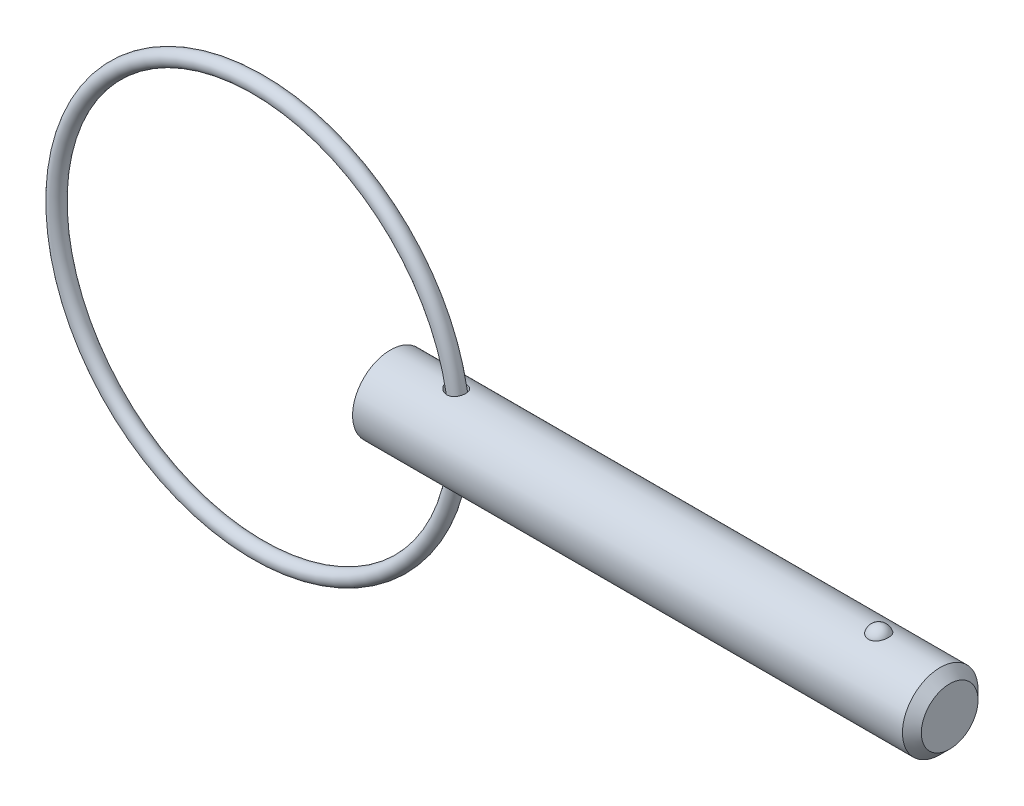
ISO-10303-21;
HEADER;
FILE_DESCRIPTION(('STEP AP214'),'2;1');
FILE_NAME('part.step','',(''),(''),'','','');
FILE_SCHEMA(('AUTOMOTIVE_DESIGN { 1 0 10303 214 1 1 1 1 }'));
ENDSEC;
DATA;
#1=APPLICATION_CONTEXT('core data for automotive mechanical design processes');
#2=APPLICATION_PROTOCOL_DEFINITION('international standard','automotive_design',2000,#1);
#3=PRODUCT_CONTEXT('',#1,'mechanical');
#4=PRODUCT('Part','Part','',(#3));
#5=PRODUCT_RELATED_PRODUCT_CATEGORY('part','',(#4));
#6=PRODUCT_DEFINITION_FORMATION('','',#4);
#7=PRODUCT_DEFINITION_CONTEXT('part definition',#1,'design');
#8=PRODUCT_DEFINITION('design','',#6,#7);
#9=PRODUCT_DEFINITION_SHAPE('','',#8);
#10=(LENGTH_UNIT() NAMED_UNIT(*) SI_UNIT(.MILLI.,.METRE.));
#11=(NAMED_UNIT(*) PLANE_ANGLE_UNIT() SI_UNIT($,.RADIAN.));
#12=(NAMED_UNIT(*) SI_UNIT($,.STERADIAN.) SOLID_ANGLE_UNIT());
#13=UNCERTAINTY_MEASURE_WITH_UNIT(LENGTH_MEASURE(1.E-05),#10,'distance_accuracy_value','');
#14=(GEOMETRIC_REPRESENTATION_CONTEXT(3) GLOBAL_UNCERTAINTY_ASSIGNED_CONTEXT((#13)) GLOBAL_UNIT_ASSIGNED_CONTEXT((#10,
#11,#12)) REPRESENTATION_CONTEXT('',''));
#15=CARTESIAN_POINT('',(0.,0.,0.));
#16=DIRECTION('',(0.,0.,1.));
#17=DIRECTION('',(1.,0.,0.));
#18=AXIS2_PLACEMENT_3D('',#15,#16,#17);
#19=CARTESIAN_POINT('',(-8.3302379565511,0.,0.));
#20=DIRECTION('',(0.,0.,1.));
#21=DIRECTION('',(1.,0.,0.));
#22=AXIS2_PLACEMENT_3D('',#19,#20,#21);
#23=TOROIDAL_SURFACE('',#22,12.7,0.476000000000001);
#24=CARTESIAN_POINT('',(4.8457620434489,0.,0.));
#25=VERTEX_POINT('',#24);
#26=VERTEX_LOOP('',#25);
#27=FACE_BOUND('',#26,.T.);
#28=ADVANCED_FACE('P0_F12',(#27),#23,.T.);
#29=CLOSED_SHELL('',(#28));
#30=MANIFOLD_SOLID_BREP('P0_B1',#29);
#31=CARTESIAN_POINT('',(0.,0.,0.));
#32=DIRECTION('',(1.,0.,0.));
#33=DIRECTION('',(0.,0.,-1.));
#34=AXIS2_PLACEMENT_3D('',#31,#32,#33);
#35=CYLINDRICAL_SURFACE('',#34,2.38);
#36=CARTESIAN_POINT('',(3.67748265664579,2.35074198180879,-0.372037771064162));
#37=CARTESIAN_POINT('',(3.70046616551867,2.34644965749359,-0.399158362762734));
#38=CARTESIAN_POINT('',(3.72581651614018,2.34199234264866,-0.424274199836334));
#39=CARTESIAN_POINT('',(3.78042747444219,2.33326580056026,-0.469907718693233));
#40=CARTESIAN_POINT('',(3.80969342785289,2.32899684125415,-0.490419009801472));
#41=CARTESIAN_POINT('',(3.87128330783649,2.32114904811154,-0.526312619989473));
#42=CARTESIAN_POINT('',(3.90360537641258,2.31756979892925,-0.541698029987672));
#43=CARTESIAN_POINT('',(3.9704452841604,2.31153734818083,-0.566889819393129));
#44=CARTESIAN_POINT('',(4.0049621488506,2.30908365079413,-0.576698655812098));
#45=CARTESIAN_POINT('',(4.07500735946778,2.30564492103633,-0.590297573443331));
#46=CARTESIAN_POINT('',(4.1105275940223,2.30465036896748,-0.594126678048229));
#47=CARTESIAN_POINT('',(4.18170718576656,2.30426876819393,-0.595606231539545));
#48=CARTESIAN_POINT('',(4.21736649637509,2.30488122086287,-0.593258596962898));
#49=CARTESIAN_POINT('',(4.28577822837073,2.30759475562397,-0.582609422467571));
#50=CARTESIAN_POINT('',(4.31858437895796,2.30961492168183,-0.57463122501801));
#51=CARTESIAN_POINT('',(4.38227060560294,2.31483318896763,-0.55323387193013));
#52=CARTESIAN_POINT('',(4.41315097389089,2.31803111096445,-0.539815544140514));
#53=CARTESIAN_POINT('',(4.4711825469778,2.3251225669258,-0.508384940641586));
#54=CARTESIAN_POINT('',(4.49841743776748,2.32899254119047,-0.490521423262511));
#55=CARTESIAN_POINT('',(4.5494826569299,2.33706025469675,-0.450515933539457));
#56=CARTESIAN_POINT('',(4.57331285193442,2.34125800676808,-0.428373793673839));
#57=CARTESIAN_POINT('',(4.6171621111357,2.34956202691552,-0.380209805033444));
#58=CARTESIAN_POINT('',(4.63714543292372,2.35366715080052,-0.354155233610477));
#59=CARTESIAN_POINT('',(4.67254725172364,2.36130301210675,-0.299034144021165));
#60=CARTESIAN_POINT('',(4.68796545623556,2.36483371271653,-0.269967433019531));
#61=CARTESIAN_POINT('',(4.71403776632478,2.37098548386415,-0.209215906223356));
#62=CARTESIAN_POINT('',(4.72462580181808,2.37359383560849,-0.177501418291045));
#63=CARTESIAN_POINT('',(4.74046966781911,2.37755210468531,-0.112692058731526));
#64=CARTESIAN_POINT('',(4.74572552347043,2.37890202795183,-0.0795971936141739));
#65=CARTESIAN_POINT('',(4.75077448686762,2.38019811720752,-0.0129544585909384));
#66=CARTESIAN_POINT('',(4.75056573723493,2.38014380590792,0.0205935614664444));
#67=CARTESIAN_POINT('',(4.74468604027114,2.37863606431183,0.087175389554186));
#68=CARTESIAN_POINT('',(4.73901506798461,2.37718262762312,0.120209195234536));
#69=CARTESIAN_POINT('',(4.72236472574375,2.37303648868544,0.184779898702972));
#70=CARTESIAN_POINT('',(4.71139268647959,2.37034549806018,0.216318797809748));
#71=CARTESIAN_POINT('',(4.68441400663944,2.36401552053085,0.277063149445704));
#72=CARTESIAN_POINT('',(4.6684071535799,2.36037649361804,0.30626850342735));
#73=CARTESIAN_POINT('',(4.63170627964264,2.35253749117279,0.361595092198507));
#74=CARTESIAN_POINT('',(4.61100040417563,2.34833610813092,0.387708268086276));
#75=CARTESIAN_POINT('',(4.56544852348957,2.33984863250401,0.43601731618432));
#76=CARTESIAN_POINT('',(4.54060272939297,2.33556254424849,0.458213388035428));
#77=CARTESIAN_POINT('',(4.48760111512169,2.32742099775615,0.497916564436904));
#78=CARTESIAN_POINT('',(4.45946763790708,2.32356294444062,0.515452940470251));
#79=CARTESIAN_POINT('',(4.40055109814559,2.31668866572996,0.545520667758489));
#80=CARTESIAN_POINT('',(4.36976845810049,2.31367230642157,0.558052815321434));
#81=CARTESIAN_POINT('',(4.30694930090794,2.30886128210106,0.577633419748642));
#82=CARTESIAN_POINT('',(4.27493988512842,2.30704826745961,0.584764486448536));
#83=CARTESIAN_POINT('',(4.21014558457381,2.30475365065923,0.593744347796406));
#84=CARTESIAN_POINT('',(4.17736068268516,2.30427207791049,0.595593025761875));
#85=CARTESIAN_POINT('',(4.11170515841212,2.30466513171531,0.59406986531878));
#86=CARTESIAN_POINT('',(4.07883545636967,2.30554895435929,0.5906626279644));
#87=CARTESIAN_POINT('',(4.01408593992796,2.30856010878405,0.578780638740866));
#88=CARTESIAN_POINT('',(3.98220636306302,2.31068773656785,0.570304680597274));
#89=CARTESIAN_POINT('',(3.91877258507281,2.31605973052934,0.548090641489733));
#90=CARTESIAN_POINT('',(3.88730095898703,2.31935100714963,0.534128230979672));
#91=CARTESIAN_POINT('',(3.82705133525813,2.32664713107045,0.501391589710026));
#92=CARTESIAN_POINT('',(3.79827429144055,2.33065222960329,0.482615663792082));
#93=CARTESIAN_POINT('',(3.7429634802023,2.3391254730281,0.439760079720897));
#94=CARTESIAN_POINT('',(3.71658313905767,2.3436062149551,0.415484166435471));
#95=CARTESIAN_POINT('',(3.6683951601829,2.35235146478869,0.362706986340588));
#96=CARTESIAN_POINT('',(3.64658727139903,2.35661598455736,0.334205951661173));
#97=CARTESIAN_POINT('',(3.60882605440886,2.36432007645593,0.27436882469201));
#98=CARTESIAN_POINT('',(3.59274982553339,2.36777633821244,0.243112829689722));
#99=CARTESIAN_POINT('',(3.56652169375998,2.3735493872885,0.178112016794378));
#100=CARTESIAN_POINT('',(3.5563653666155,2.3758670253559,0.144369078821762));
#101=CARTESIAN_POINT('',(3.54309691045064,2.37891982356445,0.0783638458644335));
#102=CARTESIAN_POINT('',(3.53947205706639,2.37976992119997,0.0462095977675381));
#103=CARTESIAN_POINT('',(3.53785288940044,2.38014795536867,-0.0182487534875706));
#104=CARTESIAN_POINT('',(3.5398575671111,2.37967612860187,-0.0505528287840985));
#105=CARTESIAN_POINT('',(3.54913867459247,2.37752661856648,-0.112617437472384));
#106=CARTESIAN_POINT('',(3.5561353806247,2.37591295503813,-0.142422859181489));
#107=CARTESIAN_POINT('',(3.5747775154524,2.37172196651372,-0.20045124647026));
#108=CARTESIAN_POINT('',(3.58642049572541,2.36914514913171,-0.228675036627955));
#109=CARTESIAN_POINT('',(3.61071901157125,2.36396321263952,-0.276620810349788));
#110=CARTESIAN_POINT('',(3.62251818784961,2.36150235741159,-0.296799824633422));
#111=CARTESIAN_POINT('',(3.64836661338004,2.35629864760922,-0.335619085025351));
#112=CARTESIAN_POINT('',(3.66241608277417,2.353555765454,-0.354259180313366));
#113=CARTESIAN_POINT('',(3.67748265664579,2.35074198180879,-0.372037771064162));
#114=B_SPLINE_CURVE_WITH_KNOTS('',3,(#36,#37,#38,#39,#40,#41,#42,#43,#44,#45,#46,#47,#48,#49,
#50,#51,#52,#53,#54,#55,#56,#57,#58,#59,#60,#61,#62,#63,#64,#65,#66,#67,#68,#69,#70,#71,#72,#73,
#74,#75,#76,#77,#78,#79,#80,#81,#82,#83,#84,#85,#86,#87,#88,#89,#90,#91,#92,#93,#94,#95,#96,#97,
#98,#99,#100,#101,#102,#103,#104,#105,#106,#107,#108,#109,#110,#111,#112,#113),.UNSPECIFIED.,
.T.,.F.,(4,2,2,2,2,2,2,2,2,2,2,2,2,2,2,2,2,2,2,2,2,2,2,2,2,2,2,2,2,2,2,2,2,2,2,2,2,2,4),(0.,
0.107335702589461,0.214819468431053,0.322238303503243,0.429609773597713,0.536277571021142,
0.642912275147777,0.743874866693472,0.844822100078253,0.942762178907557,1.04070609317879,
1.13952022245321,1.23834068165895,1.33847507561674,1.43860899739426,1.53877695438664,
1.63894536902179,1.73897565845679,1.83901017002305,1.93929990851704,2.03958453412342,
2.13922343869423,2.23884648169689,2.33691317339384,2.43498203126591,2.53371427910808,
2.63247003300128,2.73577311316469,2.83911262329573,2.94697761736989,3.05483668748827,
3.16021984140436,3.2655241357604,3.36212700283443,3.45871257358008,3.55027266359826,
3.64178456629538,3.71214035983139,3.78250304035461),.UNSPECIFIED.);
#115=CARTESIAN_POINT('',(3.67748265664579,2.35074198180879,-0.372037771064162));
#116=VERTEX_POINT('',#115);
#117=EDGE_CURVE('P1_E40',#116,#116,#114,.T.);
#118=ORIENTED_EDGE('',*,*,#117,.T.);
#119=EDGE_LOOP('',(#118));
#120=FACE_BOUND('',#119,.T.);
#121=CARTESIAN_POINT('',(34.635,0.,0.));
#122=DIRECTION('',(1.,0.,0.));
#123=DIRECTION('',(0.,0.,-1.));
#124=AXIS2_PLACEMENT_3D('',#121,#122,#123);
#125=CIRCLE('',#124,2.38);
#126=CARTESIAN_POINT('',(34.635,0.,-2.38));
#127=VERTEX_POINT('',#126);
#128=EDGE_CURVE('P1_E25',#127,#127,#125,.T.);
#129=ORIENTED_EDGE('',*,*,#128,.F.);
#130=EDGE_LOOP('',(#129));
#131=FACE_BOUND('',#130,.T.);
#132=CARTESIAN_POINT('',(0.,0.,0.));
#133=DIRECTION('',(1.,0.,0.));
#134=DIRECTION('',(0.,0.,-1.));
#135=AXIS2_PLACEMENT_3D('',#132,#133,#134);
#136=CIRCLE('',#135,2.38);
#137=CARTESIAN_POINT('',(0.,0.,-2.38));
#138=VERTEX_POINT('',#137);
#139=EDGE_CURVE('P1_E9',#138,#138,#136,.T.);
#140=ORIENTED_EDGE('',*,*,#139,.T.);
#141=EDGE_LOOP('',(#140));
#142=FACE_BOUND('',#141,.T.);
#143=CARTESIAN_POINT('',(30.7634492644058,2.2921568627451,0.640637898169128));
#144=CARTESIAN_POINT('',(30.7303559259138,2.29215737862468,0.640637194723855));
#145=CARTESIAN_POINT('',(30.6972546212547,2.29293179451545,0.637884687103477));
#146=CARTESIAN_POINT('',(30.6320176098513,2.29594030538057,0.626968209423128));
#147=CARTESIAN_POINT('',(30.5998823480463,2.29817506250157,0.618801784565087));
#148=CARTESIAN_POINT('',(30.5375402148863,2.30384308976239,0.597351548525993));
#149=CARTESIAN_POINT('',(30.5073305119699,2.30727454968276,0.584075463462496));
#150=CARTESIAN_POINT('',(30.4495674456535,2.31495941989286,0.55282960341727));
#151=CARTESIAN_POINT('',(30.4220141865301,2.31921286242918,0.53485964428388));
#152=CARTESIAN_POINT('',(30.3695938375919,2.32820213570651,0.494282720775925));
#153=CARTESIAN_POINT('',(30.3448050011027,2.33294694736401,0.471576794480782));
#154=CARTESIAN_POINT('',(30.2992169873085,2.34234144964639,0.422446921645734));
#155=CARTESIAN_POINT('',(30.2784185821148,2.34699112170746,0.396022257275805));
#156=CARTESIAN_POINT('',(30.2403580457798,2.35593942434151,0.338855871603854));
#157=CARTESIAN_POINT('',(30.2233051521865,2.36021170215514,0.30797060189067));
#158=CARTESIAN_POINT('',(30.1943607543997,2.3677057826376,0.24375057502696));
#159=CARTESIAN_POINT('',(30.1824701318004,2.37092740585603,0.210415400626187));
#160=CARTESIAN_POINT('',(30.1638076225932,2.37606901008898,0.141189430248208));
#161=CARTESIAN_POINT('',(30.1571956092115,2.37794816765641,0.105252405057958));
#162=CARTESIAN_POINT('',(30.1498095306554,2.38005135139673,0.0327351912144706));
#163=CARTESIAN_POINT('',(30.1490358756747,2.38027526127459,-0.00384504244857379));
#164=CARTESIAN_POINT('',(30.1533628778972,2.37903842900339,-0.0769838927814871));
#165=CARTESIAN_POINT('',(30.1585202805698,2.37756141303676,-0.113538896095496));
#166=CARTESIAN_POINT('',(30.1747013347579,2.37305303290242,-0.185229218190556));
#167=CARTESIAN_POINT('',(30.1857251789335,2.37002161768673,-0.220364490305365));
#168=CARTESIAN_POINT('',(30.2133977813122,2.36273722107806,-0.28815667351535));
#169=CARTESIAN_POINT('',(30.2300389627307,2.35848588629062,-0.320816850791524));
#170=CARTESIAN_POINT('',(30.2685984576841,2.34923130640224,-0.382744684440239));
#171=CARTESIAN_POINT('',(30.290516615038,2.34422808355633,-0.412012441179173));
#172=CARTESIAN_POINT('',(30.3387549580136,2.33412555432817,-0.465830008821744));
#173=CARTESIAN_POINT('',(30.365002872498,2.32902887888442,-0.490444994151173));
#174=CARTESIAN_POINT('',(30.4214769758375,2.31926941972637,-0.534700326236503));
#175=CARTESIAN_POINT('',(30.451702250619,2.3146065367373,-0.554341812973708));
#176=CARTESIAN_POINT('',(30.5140618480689,2.30645675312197,-0.587312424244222));
#177=CARTESIAN_POINT('',(30.5460780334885,2.30293152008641,-0.600855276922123));
#178=CARTESIAN_POINT('',(30.6120795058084,2.29725171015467,-0.62222045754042));
#179=CARTESIAN_POINT('',(30.6460641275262,2.29509667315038,-0.63004470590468));
#180=CARTESIAN_POINT('',(30.713299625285,2.29249264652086,-0.639452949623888));
#181=CARTESIAN_POINT('',(30.7465087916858,2.29196755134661,-0.641315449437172));
#182=CARTESIAN_POINT('',(30.812763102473,2.29246849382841,-0.639522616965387));
#183=CARTESIAN_POINT('',(30.8458082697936,2.29349430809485,-0.635868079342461));
#184=CARTESIAN_POINT('',(30.9101025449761,2.29694059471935,-0.623301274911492));
#185=CARTESIAN_POINT('',(30.9413744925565,2.29933234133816,-0.614497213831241));
#186=CARTESIAN_POINT('',(31.0019952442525,2.30522511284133,-0.592006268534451));
#187=CARTESIAN_POINT('',(31.0313438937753,2.30872622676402,-0.578318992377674));
#188=CARTESIAN_POINT('',(31.0880369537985,2.31655795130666,-0.546112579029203));
#189=CARTESIAN_POINT('',(31.115320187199,2.32090569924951,-0.527490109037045));
#190=CARTESIAN_POINT('',(31.1664904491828,2.32992206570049,-0.486117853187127));
#191=CARTESIAN_POINT('',(31.1903767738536,2.33459075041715,-0.463367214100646));
#192=CARTESIAN_POINT('',(31.2352722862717,2.34399834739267,-0.413220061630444));
#193=CARTESIAN_POINT('',(31.2560972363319,2.34873051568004,-0.385657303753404));
#194=CARTESIAN_POINT('',(31.293056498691,2.35754932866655,-0.32745560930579));
#195=CARTESIAN_POINT('',(31.3091898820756,2.36163584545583,-0.296816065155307));
#196=CARTESIAN_POINT('',(31.3369822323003,2.36889321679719,-0.232047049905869));
#197=CARTESIAN_POINT('',(31.3484450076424,2.37202275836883,-0.19782862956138));
#198=CARTESIAN_POINT('',(31.3657523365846,2.37681926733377,-0.127900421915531));
#199=CARTESIAN_POINT('',(31.3715962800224,2.37848607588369,-0.0921904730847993));
#200=CARTESIAN_POINT('',(31.377605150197,2.38020024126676,-0.0196348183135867));
#201=CARTESIAN_POINT('',(31.3776704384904,2.38021918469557,0.0172198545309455));
#202=CARTESIAN_POINT('',(31.3718689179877,2.37856356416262,0.0904219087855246));
#203=CARTESIAN_POINT('',(31.3660018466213,2.37688892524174,0.126769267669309));
#204=CARTESIAN_POINT('',(31.348425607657,2.37201688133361,0.198028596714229));
#205=CARTESIAN_POINT('',(31.336699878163,2.36881516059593,0.232936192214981));
#206=CARTESIAN_POINT('',(31.3076354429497,2.36123444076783,0.30019678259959));
#207=CARTESIAN_POINT('',(31.2902967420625,2.3568554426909,0.332549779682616));
#208=CARTESIAN_POINT('',(31.2505350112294,2.34744667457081,0.393495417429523));
#209=CARTESIAN_POINT('',(31.2281528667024,2.34242227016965,0.422115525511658));
#210=CARTESIAN_POINT('',(31.1787391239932,2.33227293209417,0.475004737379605));
#211=CARTESIAN_POINT('',(31.1517076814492,2.32714800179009,0.4992739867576));
#212=CARTESIAN_POINT('',(31.0944988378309,2.31755359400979,0.542046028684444));
#213=CARTESIAN_POINT('',(31.0644297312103,2.31306986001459,0.560690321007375));
#214=CARTESIAN_POINT('',(31.0013869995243,2.3051412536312,0.592447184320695));
#215=CARTESIAN_POINT('',(30.9684158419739,2.30169550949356,0.605564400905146));
#216=CARTESIAN_POINT('',(30.9068424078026,2.29677744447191,0.623927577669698));
#217=CARTESIAN_POINT('',(30.8785555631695,2.29505839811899,0.630178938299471));
#218=CARTESIAN_POINT('',(30.8213308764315,2.29274795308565,0.638534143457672));
#219=CARTESIAN_POINT('',(30.7923931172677,2.29215641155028,0.64063851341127));
#220=CARTESIAN_POINT('',(30.7634492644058,2.2921568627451,0.640637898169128));
#221=B_SPLINE_CURVE_WITH_KNOTS('',3,(#143,#144,#145,#146,#147,#148,#149,#150,#151,#152,#153,
#154,#155,#156,#157,#158,#159,#160,#161,#162,#163,#164,#165,#166,#167,#168,#169,#170,#171,#172,
#173,#174,#175,#176,#177,#178,#179,#180,#181,#182,#183,#184,#185,#186,#187,#188,#189,#190,#191,
#192,#193,#194,#195,#196,#197,#198,#199,#200,#201,#202,#203,#204,#205,#206,#207,#208,#209,#210,
#211,#212,#213,#214,#215,#216,#217,#218,#219,#220),.UNSPECIFIED.,.T.,.F.,(4,2,2,2,2,2,2,2,2,2,2,
2,2,2,2,2,2,2,2,2,2,2,2,2,2,2,2,2,2,2,2,2,2,2,2,2,2,2,4),(0.,0.0991724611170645,
0.198389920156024,0.297457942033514,0.396529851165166,0.497927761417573,0.599345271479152,
0.705475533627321,0.811623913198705,0.920876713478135,1.03013718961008,1.1404517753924,
1.25076998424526,1.3609399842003,1.47110672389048,1.57959248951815,1.6880533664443,
1.79234266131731,1.89659691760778,1.99590391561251,2.0951966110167,2.19247425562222,
2.28975970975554,2.38926978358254,2.48880044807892,2.59293588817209,2.69709193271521,
2.80525821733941,2.91343624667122,3.02347917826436,3.13352698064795,3.24388765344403,
3.35424823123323,3.46374443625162,3.57323697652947,3.67968690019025,3.78604717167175,
3.87279565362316,3.95953314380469),.UNSPECIFIED.);
#222=CARTESIAN_POINT('',(30.7634492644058,2.2921568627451,0.640637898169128));
#223=VERTEX_POINT('',#222);
#224=EDGE_CURVE('P1_E34',#223,#223,#221,.T.);
#225=ORIENTED_EDGE('',*,*,#224,.T.);
#226=EDGE_LOOP('',(#225));
#227=FACE_BOUND('',#226,.T.);
#228=CARTESIAN_POINT('',(3.67748265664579,-2.35074198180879,-0.372037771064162));
#229=CARTESIAN_POINT('',(3.65652023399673,-2.35465684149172,-0.34730037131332));
#230=CARTESIAN_POINT('',(3.63751328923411,-2.35843676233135,-0.320880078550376));
#231=CARTESIAN_POINT('',(3.60404107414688,-2.36534227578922,-0.265218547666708));
#232=CARTESIAN_POINT('',(3.58957485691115,-2.36846800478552,-0.235977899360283));
#233=CARTESIAN_POINT('',(3.56572865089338,-2.37373250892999,-0.17528149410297));
#234=CARTESIAN_POINT('',(3.55636565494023,-2.37586798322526,-0.143818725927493));
#235=CARTESIAN_POINT('',(3.54325775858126,-2.37888184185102,-0.0796854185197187));
#236=CARTESIAN_POINT('',(3.539510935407,-2.37976065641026,-0.0470152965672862));
#237=CARTESIAN_POINT('',(3.53787230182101,-2.38014359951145,0.0167788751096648));
#238=CARTESIAN_POINT('',(3.53968714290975,-2.37971660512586,0.0478953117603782));
#239=CARTESIAN_POINT('',(3.54844977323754,-2.37768530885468,0.109352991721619));
#240=CARTESIAN_POINT('',(3.55539746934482,-2.37608102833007,0.139694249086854));
#241=CARTESIAN_POINT('',(3.57400783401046,-2.37189301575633,0.198451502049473));
#242=CARTESIAN_POINT('',(3.58561918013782,-2.36931996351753,0.226884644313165));
#243=CARTESIAN_POINT('',(3.61310377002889,-2.36345094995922,0.281524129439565));
#244=CARTESIAN_POINT('',(3.62897804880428,-2.36015481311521,0.30772992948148));
#245=CARTESIAN_POINT('',(3.66562367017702,-2.35291979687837,0.359001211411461));
#246=CARTESIAN_POINT('',(3.68664499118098,-2.34895316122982,0.383883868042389));
#247=CARTESIAN_POINT('',(3.73230875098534,-2.34094029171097,0.430056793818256));
#248=CARTESIAN_POINT('',(3.75695270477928,-2.33689402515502,0.451345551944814));
#249=CARTESIAN_POINT('',(3.81128123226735,-2.32880869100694,0.491427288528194));
#250=CARTESIAN_POINT('',(3.84120889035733,-2.32479472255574,0.509896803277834));
#251=CARTESIAN_POINT('',(3.90376464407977,-2.31758417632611,0.541729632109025));
#252=CARTESIAN_POINT('',(3.93639323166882,-2.31438774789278,0.555092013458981));
#253=CARTESIAN_POINT('',(4.00416670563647,-2.30915137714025,0.576493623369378));
#254=CARTESIAN_POINT('',(4.0393485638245,-2.30713552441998,0.584422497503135));
#255=CARTESIAN_POINT('',(4.11060438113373,-2.30465258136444,0.594140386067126));
#256=CARTESIAN_POINT('',(4.14667802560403,-2.30418495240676,0.595931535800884));
#257=CARTESIAN_POINT('',(4.21693481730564,-2.30488473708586,0.593218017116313));
#258=CARTESIAN_POINT('',(4.25112951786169,-2.3059789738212,0.588995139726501));
#259=CARTESIAN_POINT('',(4.31821509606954,-2.30956729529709,0.57476284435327));
#260=CARTESIAN_POINT('',(4.35110629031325,-2.31206103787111,0.564754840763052));
#261=CARTESIAN_POINT('',(4.41316900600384,-2.31802118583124,0.53975368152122));
#262=CARTESIAN_POINT('',(4.44243993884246,-2.32144077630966,0.524995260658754));
#263=CARTESIAN_POINT('',(4.49802365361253,-2.32890801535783,0.49080792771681));
#264=CARTESIAN_POINT('',(4.52433643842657,-2.33295566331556,0.471379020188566));
#265=CARTESIAN_POINT('',(4.57327790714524,-2.3412242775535,0.428422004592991));
#266=CARTESIAN_POINT('',(4.59591094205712,-2.34544503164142,0.404898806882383));
#267=CARTESIAN_POINT('',(4.63697038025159,-2.35360640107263,0.354387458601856));
#268=CARTESIAN_POINT('',(4.65539647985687,-2.35754699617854,0.327399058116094));
#269=CARTESIAN_POINT('',(4.68784943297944,-2.36478461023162,0.270249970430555));
#270=CARTESIAN_POINT('',(4.70180333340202,-2.36807065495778,0.240046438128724));
#271=CARTESIAN_POINT('',(4.72457181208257,-2.3735656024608,0.177668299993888));
#272=CARTESIAN_POINT('',(4.73338630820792,-2.37577448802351,0.145493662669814));
#273=CARTESIAN_POINT('',(4.74568442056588,-2.37888446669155,0.0799353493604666));
#274=CARTESIAN_POINT('',(4.74914498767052,-2.37977990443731,0.0465470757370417));
#275=CARTESIAN_POINT('',(4.75057509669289,-2.38014803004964,-0.0203543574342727));
#276=CARTESIAN_POINT('',(4.74854468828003,-2.37962073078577,-0.0538675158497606));
#277=CARTESIAN_POINT('',(4.73905606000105,-2.37720346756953,-0.119981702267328));
#278=CARTESIAN_POINT('',(4.73161109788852,-2.37531683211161,-0.152584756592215));
#279=CARTESIAN_POINT('',(4.71149336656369,-2.37038779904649,-0.216044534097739));
#280=CARTESIAN_POINT('',(4.69882040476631,-2.36734535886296,-0.246901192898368));
#281=CARTESIAN_POINT('',(4.66852750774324,-2.3604270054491,-0.306062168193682));
#282=CARTESIAN_POINT('',(4.65089743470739,-2.35654938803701,-0.334361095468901));
#283=CARTESIAN_POINT('',(4.61113860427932,-2.34839114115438,-0.387535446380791));
#284=CARTESIAN_POINT('',(4.5890098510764,-2.34411051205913,-0.412410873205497));
#285=CARTESIAN_POINT('',(4.54086484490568,-2.33563475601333,-0.457982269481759));
#286=CARTESIAN_POINT('',(4.51485596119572,-2.33143948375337,-0.478685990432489));
#287=CARTESIAN_POINT('',(4.45962330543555,-2.32360655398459,-0.515369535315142));
#288=CARTESIAN_POINT('',(4.43040000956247,-2.31996881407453,-0.531350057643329));
#289=CARTESIAN_POINT('',(4.37002624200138,-2.31371771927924,-0.557938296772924));
#290=CARTESIAN_POINT('',(4.33891082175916,-2.31108995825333,-0.568622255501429));
#291=CARTESIAN_POINT('',(4.27527207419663,-2.30707117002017,-0.584715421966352));
#292=CARTESIAN_POINT('',(4.24274884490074,-2.30568005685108,-0.590124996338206));
#293=CARTESIAN_POINT('',(4.17738918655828,-2.30427145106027,-0.595601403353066));
#294=CARTESIAN_POINT('',(4.14455499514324,-2.3042474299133,-0.595693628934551));
#295=CARTESIAN_POINT('',(4.07930726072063,-2.30552664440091,-0.590722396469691));
#296=CARTESIAN_POINT('',(4.04689380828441,-2.3068301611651,-0.585657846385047));
#297=CARTESIAN_POINT('',(3.98220150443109,-2.31066076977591,-0.570360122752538));
#298=CARTESIAN_POINT('',(3.94996602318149,-2.31322859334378,-0.559954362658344));
#299=CARTESIAN_POINT('',(3.88760707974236,-2.31930140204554,-0.534242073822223));
#300=CARTESIAN_POINT('',(3.85748403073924,-2.32280656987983,-0.518934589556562));
#301=CARTESIAN_POINT('',(3.80033132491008,-2.33034138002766,-0.483968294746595));
#302=CARTESIAN_POINT('',(3.77327623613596,-2.33436601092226,-0.46434994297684));
#303=CARTESIAN_POINT('',(3.72262060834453,-2.34255524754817,-0.421092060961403));
#304=CARTESIAN_POINT('',(3.69901956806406,-2.34671983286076,-0.397453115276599));
#305=CARTESIAN_POINT('',(3.67748265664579,-2.35074198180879,-0.372037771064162));
#306=B_SPLINE_CURVE_WITH_KNOTS('',3,(#228,#229,#230,#231,#232,#233,#234,#235,#236,#237,#238,
#239,#240,#241,#242,#243,#244,#245,#246,#247,#248,#249,#250,#251,#252,#253,#254,#255,#256,#257,
#258,#259,#260,#261,#262,#263,#264,#265,#266,#267,#268,#269,#270,#271,#272,#273,#274,#275,#276,
#277,#278,#279,#280,#281,#282,#283,#284,#285,#286,#287,#288,#289,#290,#291,#292,#293,#294,#295,
#296,#297,#298,#299,#300,#301,#302,#303,#304,#305),.UNSPECIFIED.,.T.,.F.,(4,2,2,2,2,2,2,2,2,2,2,
2,2,2,2,2,2,2,2,2,2,2,2,2,2,2,2,2,2,2,2,2,2,2,2,2,2,2,4),(0.,0.0978755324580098,
0.195730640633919,0.293909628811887,0.39205499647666,0.485114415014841,0.578172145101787,
0.670232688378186,0.762315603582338,0.860342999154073,0.958411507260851,1.06411708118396,
1.16984195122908,1.27765506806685,1.38543067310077,1.48831936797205,1.59118291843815,
1.68959047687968,1.78799793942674,1.88628818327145,1.98458551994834,2.08441314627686,
2.18424236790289,2.28450017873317,2.3847570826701,2.4847693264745,2.58478525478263,
2.68500723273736,2.78522911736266,2.8852630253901,2.98528213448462,3.08381637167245,
3.18234375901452,3.28040059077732,3.37847819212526,3.47994551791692,3.58143263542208,
3.68200512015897,3.78256299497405),.UNSPECIFIED.);
#307=CARTESIAN_POINT('',(3.67748265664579,-2.35074198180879,-0.372037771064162));
#308=VERTEX_POINT('',#307);
#309=EDGE_CURVE('P1_E17',#308,#308,#306,.T.);
#310=ORIENTED_EDGE('',*,*,#309,.T.);
#311=EDGE_LOOP('',(#310));
#312=FACE_BOUND('',#311,.T.);
#313=ADVANCED_FACE('P1_F13',(#120,#131,#142,#227,#312),#35,.T.);
#314=CARTESIAN_POINT('',(0.,0.,0.));
#315=DIRECTION('',(-1.,0.,0.));
#316=DIRECTION('',(0.,0.,1.));
#317=AXIS2_PLACEMENT_3D('',#314,#315,#316);
#318=PLANE('',#317);
#319=ORIENTED_EDGE('',*,*,#139,.F.);
#320=EDGE_LOOP('',(#319));
#321=FACE_BOUND('',#320,.T.);
#322=ADVANCED_FACE('P1_F15',(#321),#318,.T.);
#323=CARTESIAN_POINT('',(35.23,0.,0.));
#324=DIRECTION('',(-1.,0.,0.));
#325=DIRECTION('',(0.,0.,1.));
#326=AXIS2_PLACEMENT_3D('',#323,#324,#325);
#327=CONICAL_SURFACE('',#326,1.785,0.785398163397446);
#328=ORIENTED_EDGE('',*,*,#128,.T.);
#329=EDGE_LOOP('',(#328));
#330=FACE_BOUND('',#329,.T.);
#331=CARTESIAN_POINT('',(35.23,0.,0.));
#332=DIRECTION('',(1.,0.,0.));
#333=DIRECTION('',(0.,0.,-1.));
#334=AXIS2_PLACEMENT_3D('',#331,#332,#333);
#335=CIRCLE('',#334,1.785);
#336=CARTESIAN_POINT('',(35.23,0.,-1.785));
#337=VERTEX_POINT('',#336);
#338=EDGE_CURVE('P1_E30',#337,#337,#335,.T.);
#339=ORIENTED_EDGE('',*,*,#338,.F.);
#340=EDGE_LOOP('',(#339));
#341=FACE_BOUND('',#340,.T.);
#342=ADVANCED_FACE('P1_F55',(#330,#341),#327,.T.);
#343=CARTESIAN_POINT('',(35.23,1.785,0.));
#344=DIRECTION('',(1.,0.,0.));
#345=DIRECTION('',(0.,0.,-1.));
#346=AXIS2_PLACEMENT_3D('',#343,#344,#345);
#347=PLANE('',#346);
#348=ORIENTED_EDGE('',*,*,#338,.T.);
#349=EDGE_LOOP('',(#348));
#350=FACE_BOUND('',#349,.T.);
#351=ADVANCED_FACE('P1_F51',(#350),#347,.T.);
#352=CARTESIAN_POINT('',(30.7634492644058,2.142,0.));
#353=DIRECTION('',(-1.,0.,0.));
#354=DIRECTION('',(0.,1.,0.));
#355=AXIS2_PLACEMENT_3D('',#352,#353,#354);
#356=SPHERICAL_SURFACE('',#355,0.658000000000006);
#357=ORIENTED_EDGE('',*,*,#224,.F.);
#358=EDGE_LOOP('',(#357));
#359=FACE_BOUND('',#358,.T.);
#360=ADVANCED_FACE('P1_F46',(#359),#356,.T.);
#361=CARTESIAN_POINT('',(-8.3302379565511,0.,0.));
#362=DIRECTION('',(0.,0.,1.));
#363=DIRECTION('',(1.,0.,0.));
#364=AXIS2_PLACEMENT_3D('',#361,#362,#363);
#365=TOROIDAL_SURFACE('',#364,12.7,0.594999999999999);
#366=ORIENTED_EDGE('',*,*,#309,.F.);
#367=EDGE_LOOP('',(#366));
#368=FACE_BOUND('',#367,.T.);
#369=ORIENTED_EDGE('',*,*,#117,.F.);
#370=EDGE_LOOP('',(#369));
#371=FACE_BOUND('',#370,.T.);
#372=ADVANCED_FACE('P1_F50',(#368,#371),#365,.F.);
#373=CLOSED_SHELL('',(#313,#322,#342,#351,#360,#372));
#374=MANIFOLD_SOLID_BREP('P1_B1',#373);
#375=ADVANCED_BREP_SHAPE_REPRESENTATION('',(#18,#30,#374),#14);
#376=SHAPE_DEFINITION_REPRESENTATION(#9,#375);
ENDSEC;
END-ISO-10303-21;
